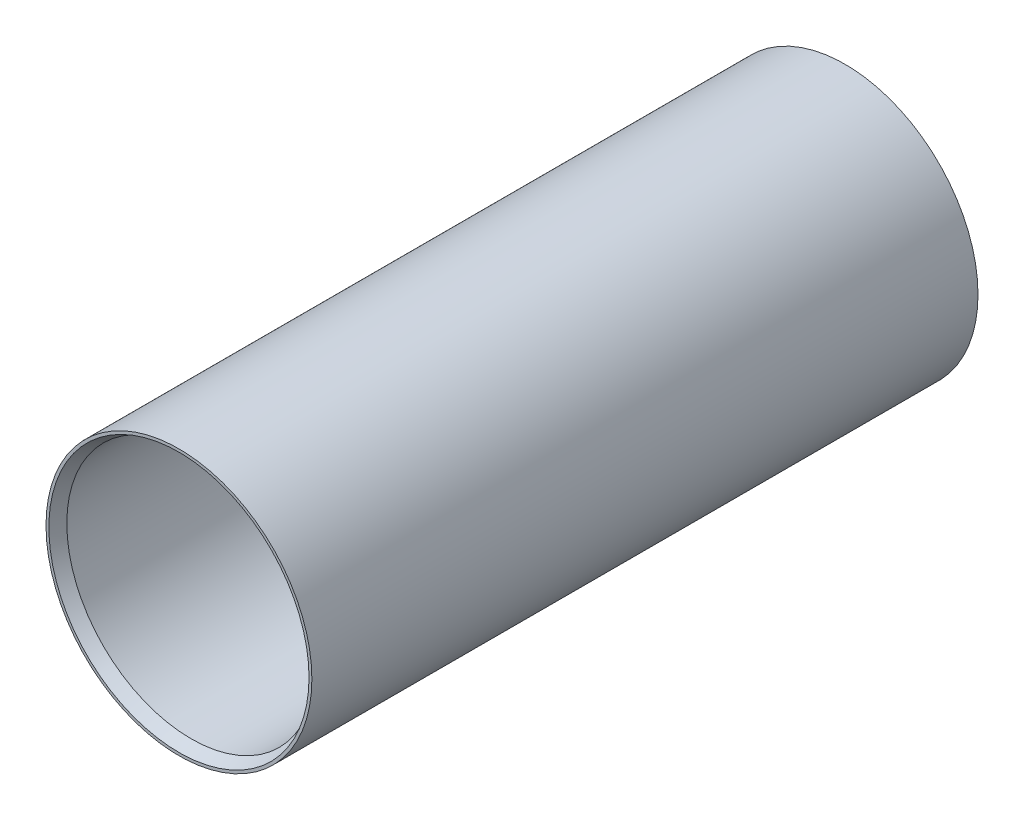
ISO-10303-21;
HEADER;
FILE_DESCRIPTION(('STEP AP214'),'2;1');
FILE_NAME('part.step','',(''),(''),'','','');
FILE_SCHEMA(('AUTOMOTIVE_DESIGN { 1 0 10303 214 1 1 1 1 }'));
ENDSEC;
DATA;
#1=APPLICATION_CONTEXT('core data for automotive mechanical design processes');
#2=APPLICATION_PROTOCOL_DEFINITION('international standard','automotive_design',2000,#1);
#3=PRODUCT_CONTEXT('',#1,'mechanical');
#4=PRODUCT('Part','Part','',(#3));
#5=PRODUCT_RELATED_PRODUCT_CATEGORY('part','',(#4));
#6=PRODUCT_DEFINITION_FORMATION('','',#4);
#7=PRODUCT_DEFINITION_CONTEXT('part definition',#1,'design');
#8=PRODUCT_DEFINITION('design','',#6,#7);
#9=PRODUCT_DEFINITION_SHAPE('','',#8);
#10=(LENGTH_UNIT() NAMED_UNIT(*) SI_UNIT(.MILLI.,.METRE.));
#11=(NAMED_UNIT(*) PLANE_ANGLE_UNIT() SI_UNIT($,.RADIAN.));
#12=(NAMED_UNIT(*) SI_UNIT($,.STERADIAN.) SOLID_ANGLE_UNIT());
#13=UNCERTAINTY_MEASURE_WITH_UNIT(LENGTH_MEASURE(1.E-05),#10,'distance_accuracy_value','');
#14=(GEOMETRIC_REPRESENTATION_CONTEXT(3) GLOBAL_UNCERTAINTY_ASSIGNED_CONTEXT((#13)) GLOBAL_UNIT_ASSIGNED_CONTEXT((#10,
#11,#12)) REPRESENTATION_CONTEXT('',''));
#15=CARTESIAN_POINT('',(0.,0.,0.));
#16=DIRECTION('',(0.,0.,1.));
#17=DIRECTION('',(1.,0.,0.));
#18=AXIS2_PLACEMENT_3D('',#15,#16,#17);
#19=CARTESIAN_POINT('',(0.,0.,547.565634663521));
#20=DIRECTION('',(0.,0.,-1.));
#21=DIRECTION('',(-1.,0.,0.));
#22=AXIS2_PLACEMENT_3D('',#19,#20,#21);
#23=CYLINDRICAL_SURFACE('',#22,69.85);
#24=CARTESIAN_POINT('',(0.,0.,0.));
#25=DIRECTION('',(0.,0.,1.));
#26=DIRECTION('',(1.,0.,0.));
#27=AXIS2_PLACEMENT_3D('',#24,#25,#26);
#28=CIRCLE('',#27,69.85);
#29=CARTESIAN_POINT('',(69.85,0.,0.));
#30=VERTEX_POINT('',#29);
#31=EDGE_CURVE('E52',#30,#30,#28,.T.);
#32=ORIENTED_EDGE('',*,*,#31,.T.);
#33=EDGE_LOOP('',(#32));
#34=FACE_BOUND('',#33,.T.);
#35=CARTESIAN_POINT('',(0.,0.,350.));
#36=DIRECTION('',(0.,0.,1.));
#37=DIRECTION('',(1.,0.,0.));
#38=AXIS2_PLACEMENT_3D('',#35,#36,#37);
#39=CIRCLE('',#38,69.85);
#40=CARTESIAN_POINT('',(69.85,0.,350.));
#41=VERTEX_POINT('',#40);
#42=EDGE_CURVE('E48',#41,#41,#39,.T.);
#43=ORIENTED_EDGE('',*,*,#42,.F.);
#44=EDGE_LOOP('',(#43));
#45=FACE_BOUND('',#44,.T.);
#46=ADVANCED_FACE('F37',(#34,#45),#23,.T.);
#47=CARTESIAN_POINT('',(0.,0.,0.));
#48=DIRECTION('',(0.,0.,1.));
#49=DIRECTION('',(1.,0.,0.));
#50=AXIS2_PLACEMENT_3D('',#47,#48,#49);
#51=PLANE('',#50);
#52=ORIENTED_EDGE('',*,*,#31,.F.);
#53=EDGE_LOOP('',(#52));
#54=FACE_BOUND('',#53,.T.);
#55=CARTESIAN_POINT('',(0.,0.,0.));
#56=DIRECTION('',(0.,0.,1.));
#57=DIRECTION('',(1.,0.,0.));
#58=AXIS2_PLACEMENT_3D('',#55,#56,#57);
#59=CIRCLE('',#58,65.35);
#60=CARTESIAN_POINT('',(65.35,0.,0.));
#61=VERTEX_POINT('',#60);
#62=EDGE_CURVE('E57',#61,#61,#59,.T.);
#63=ORIENTED_EDGE('',*,*,#62,.T.);
#64=EDGE_LOOP('',(#63));
#65=FACE_BOUND('',#64,.T.);
#66=ADVANCED_FACE('F61',(#54,#65),#51,.F.);
#67=CARTESIAN_POINT('',(0.,0.,547.565634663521));
#68=DIRECTION('',(0.,0.,-1.));
#69=DIRECTION('',(-1.,0.,0.));
#70=AXIS2_PLACEMENT_3D('',#67,#68,#69);
#71=CYLINDRICAL_SURFACE('',#70,65.35);
#72=CARTESIAN_POINT('',(0.,0.,343.566479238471));
#73=DIRECTION('',(0.,0.,1.));
#74=DIRECTION('',(1.,0.,0.));
#75=AXIS2_PLACEMENT_3D('',#72,#73,#74);
#76=CIRCLE('',#75,65.35);
#77=CARTESIAN_POINT('',(65.35,0.,343.566479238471));
#78=VERTEX_POINT('',#77);
#79=EDGE_CURVE('E44',#78,#78,#76,.T.);
#80=ORIENTED_EDGE('',*,*,#79,.T.);
#81=EDGE_LOOP('',(#80));
#82=FACE_BOUND('',#81,.T.);
#83=ORIENTED_EDGE('',*,*,#62,.F.);
#84=EDGE_LOOP('',(#83));
#85=FACE_BOUND('',#84,.T.);
#86=ADVANCED_FACE('F63',(#82,#85),#71,.F.);
#87=CARTESIAN_POINT('',(0.,0.,350.));
#88=DIRECTION('',(0.,0.,1.));
#89=DIRECTION('',(1.,0.,0.));
#90=AXIS2_PLACEMENT_3D('',#87,#88,#89);
#91=PLANE('',#90);
#92=CARTESIAN_POINT('',(0.,0.,350.));
#93=DIRECTION('',(0.,0.,1.));
#94=DIRECTION('',(1.,0.,0.));
#95=AXIS2_PLACEMENT_3D('',#92,#93,#94);
#96=CIRCLE('',#95,68.3500000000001);
#97=CARTESIAN_POINT('',(68.3500000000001,0.,350.));
#98=VERTEX_POINT('',#97);
#99=EDGE_CURVE('E10',#98,#98,#96,.F.);
#100=ORIENTED_EDGE('',*,*,#99,.T.);
#101=EDGE_LOOP('',(#100));
#102=FACE_BOUND('',#101,.T.);
#103=ORIENTED_EDGE('',*,*,#42,.T.);
#104=EDGE_LOOP('',(#103));
#105=FACE_BOUND('',#104,.T.);
#106=ADVANCED_FACE('F65',(#102,#105),#91,.T.);
#107=CARTESIAN_POINT('',(0.,0.,343.566479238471));
#108=DIRECTION('',(0.,0.,1.));
#109=DIRECTION('',(1.,0.,0.));
#110=AXIS2_PLACEMENT_3D('',#107,#108,#109);
#111=CONICAL_SURFACE('',#110,65.35,0.436332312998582);
#112=ORIENTED_EDGE('',*,*,#99,.F.);
#113=EDGE_LOOP('',(#112));
#114=FACE_BOUND('',#113,.T.);
#115=ORIENTED_EDGE('',*,*,#79,.F.);
#116=EDGE_LOOP('',(#115));
#117=FACE_BOUND('',#116,.T.);
#118=ADVANCED_FACE('F39',(#114,#117),#111,.F.);
#119=CLOSED_SHELL('',(#46,#66,#86,#106,#118));
#120=MANIFOLD_SOLID_BREP('B2',#119);
#121=ADVANCED_BREP_SHAPE_REPRESENTATION('',(#18,#120),#14);
#122=SHAPE_DEFINITION_REPRESENTATION(#9,#121);
ENDSEC;
END-ISO-10303-21;
